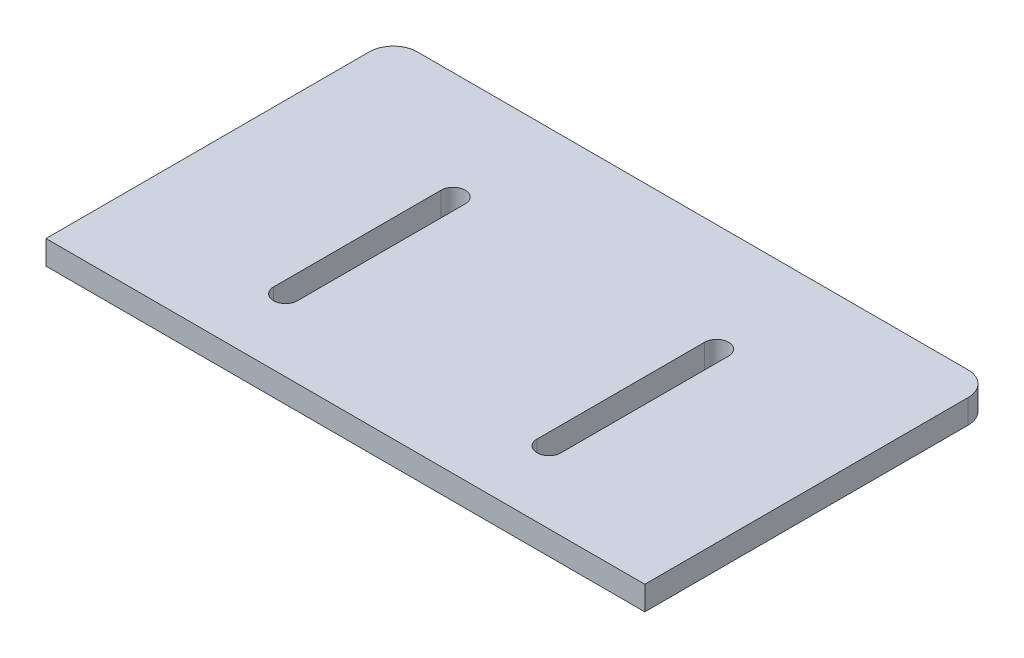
ISO-10303-21;
HEADER;
FILE_DESCRIPTION(('STEP AP214'),'2;1');
FILE_NAME('part.step','',(''),(''),'','','');
FILE_SCHEMA(('AUTOMOTIVE_DESIGN { 1 0 10303 214 1 1 1 1 }'));
ENDSEC;
DATA;
#1=APPLICATION_CONTEXT('core data for automotive mechanical design processes');
#2=APPLICATION_PROTOCOL_DEFINITION('international standard','automotive_design',2000,#1);
#3=PRODUCT_CONTEXT('',#1,'mechanical');
#4=PRODUCT('Part','Part','',(#3));
#5=PRODUCT_RELATED_PRODUCT_CATEGORY('part','',(#4));
#6=PRODUCT_DEFINITION_FORMATION('','',#4);
#7=PRODUCT_DEFINITION_CONTEXT('part definition',#1,'design');
#8=PRODUCT_DEFINITION('design','',#6,#7);
#9=PRODUCT_DEFINITION_SHAPE('','',#8);
#10=(LENGTH_UNIT() NAMED_UNIT(*) SI_UNIT(.MILLI.,.METRE.));
#11=(NAMED_UNIT(*) PLANE_ANGLE_UNIT() SI_UNIT($,.RADIAN.));
#12=(NAMED_UNIT(*) SI_UNIT($,.STERADIAN.) SOLID_ANGLE_UNIT());
#13=UNCERTAINTY_MEASURE_WITH_UNIT(LENGTH_MEASURE(1.E-05),#10,'distance_accuracy_value','');
#14=(GEOMETRIC_REPRESENTATION_CONTEXT(3) GLOBAL_UNCERTAINTY_ASSIGNED_CONTEXT((#13)) GLOBAL_UNIT_ASSIGNED_CONTEXT((#10,
#11,#12)) REPRESENTATION_CONTEXT('',''));
#15=CARTESIAN_POINT('',(0.,0.,0.));
#16=DIRECTION('',(0.,0.,1.));
#17=DIRECTION('',(1.,0.,0.));
#18=AXIS2_PLACEMENT_3D('',#15,#16,#17);
#19=CARTESIAN_POINT('',(-23.,2.,-12.5));
#20=DIRECTION('',(0.,1.,0.));
#21=DIRECTION('',(0.,0.,1.));
#22=AXIS2_PLACEMENT_3D('',#19,#20,#21);
#23=PLANE('',#22);
#24=DIRECTION('',(0.,0.,1.));
#25=VECTOR('',#24,1.);
#26=CARTESIAN_POINT('',(-12.,2.,-5.5));
#27=LINE('',#26,#25);
#28=CARTESIAN_POINT('',(-12.,2.,-5.5));
#29=VERTEX_POINT('',#28);
#30=CARTESIAN_POINT('',(-12.,2.,8.5));
#31=VERTEX_POINT('',#30);
#32=EDGE_CURVE('E171',#29,#31,#27,.T.);
#33=ORIENTED_EDGE('',*,*,#32,.F.);
#34=CARTESIAN_POINT('',(-11.,2.,-5.5));
#35=DIRECTION('',(0.,1.,0.));
#36=DIRECTION('',(0.,0.,1.));
#37=AXIS2_PLACEMENT_3D('',#34,#35,#36);
#38=CIRCLE('',#37,1.);
#39=CARTESIAN_POINT('',(-10.,2.,-5.5));
#40=VERTEX_POINT('',#39);
#41=EDGE_CURVE('E169',#40,#29,#38,.T.);
#42=ORIENTED_EDGE('',*,*,#41,.F.);
#43=DIRECTION('',(0.,0.,-1.));
#44=VECTOR('',#43,1.);
#45=CARTESIAN_POINT('',(-10.,2.,-5.5));
#46=LINE('',#45,#44);
#47=CARTESIAN_POINT('',(-10.,2.,8.5));
#48=VERTEX_POINT('',#47);
#49=EDGE_CURVE('E177',#48,#40,#46,.T.);
#50=ORIENTED_EDGE('',*,*,#49,.F.);
#51=CARTESIAN_POINT('',(-11.,2.,8.5));
#52=DIRECTION('',(0.,1.,0.));
#53=DIRECTION('',(0.,0.,1.));
#54=AXIS2_PLACEMENT_3D('',#51,#52,#53);
#55=CIRCLE('',#54,0.999999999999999);
#56=EDGE_CURVE('E174',#31,#48,#55,.T.);
#57=ORIENTED_EDGE('',*,*,#56,.F.);
#58=EDGE_LOOP('',(#33,#42,#50,#57));
#59=FACE_BOUND('',#58,.T.);
#60=DIRECTION('',(0.,0.,-1.));
#61=VECTOR('',#60,1.);
#62=CARTESIAN_POINT('',(25.,2.,-12.5));
#63=LINE('',#62,#61);
#64=CARTESIAN_POINT('',(25.,2.,14.5));
#65=VERTEX_POINT('',#64);
#66=CARTESIAN_POINT('',(25.,2.,-12.5));
#67=VERTEX_POINT('',#66);
#68=EDGE_CURVE('E200',#65,#67,#63,.T.);
#69=ORIENTED_EDGE('',*,*,#68,.T.);
#70=CARTESIAN_POINT('',(23.,2.,-12.5));
#71=DIRECTION('',(0.,1.,0.));
#72=DIRECTION('',(0.,0.,-1.));
#73=AXIS2_PLACEMENT_3D('',#70,#71,#72);
#74=CIRCLE('',#73,2.);
#75=CARTESIAN_POINT('',(23.,2.,-14.5));
#76=VERTEX_POINT('',#75);
#77=EDGE_CURVE('E203',#67,#76,#74,.T.);
#78=ORIENTED_EDGE('',*,*,#77,.T.);
#79=DIRECTION('',(-1.,0.,0.));
#80=VECTOR('',#79,1.);
#81=CARTESIAN_POINT('',(-23.,2.,-14.5));
#82=LINE('',#81,#80);
#83=CARTESIAN_POINT('',(-23.,2.,-14.5));
#84=VERTEX_POINT('',#83);
#85=EDGE_CURVE('E206',#76,#84,#82,.T.);
#86=ORIENTED_EDGE('',*,*,#85,.T.);
#87=CARTESIAN_POINT('',(-23.,2.,-12.5));
#88=DIRECTION('',(0.,1.,0.));
#89=DIRECTION('',(0.,0.,1.));
#90=AXIS2_PLACEMENT_3D('',#87,#88,#89);
#91=CIRCLE('',#90,2.);
#92=CARTESIAN_POINT('',(-25.,2.,-12.5));
#93=VERTEX_POINT('',#92);
#94=EDGE_CURVE('E208',#84,#93,#91,.T.);
#95=ORIENTED_EDGE('',*,*,#94,.T.);
#96=DIRECTION('',(0.,0.,1.));
#97=VECTOR('',#96,1.);
#98=CARTESIAN_POINT('',(-25.,2.,-12.5));
#99=LINE('',#98,#97);
#100=CARTESIAN_POINT('',(-25.,2.,14.5));
#101=VERTEX_POINT('',#100);
#102=EDGE_CURVE('E210',#93,#101,#99,.T.);
#103=ORIENTED_EDGE('',*,*,#102,.T.);
#104=DIRECTION('',(1.,0.,0.));
#105=VECTOR('',#104,1.);
#106=CARTESIAN_POINT('',(-25.,2.,14.5));
#107=LINE('',#106,#105);
#108=EDGE_CURVE('E212',#101,#65,#107,.T.);
#109=ORIENTED_EDGE('',*,*,#108,.T.);
#110=EDGE_LOOP('',(#69,#78,#86,#95,#103,#109));
#111=FACE_BOUND('',#110,.T.);
#112=DIRECTION('',(0.,0.,1.));
#113=VECTOR('',#112,1.);
#114=CARTESIAN_POINT('',(10.,2.,-5.5));
#115=LINE('',#114,#113);
#116=CARTESIAN_POINT('',(10.,2.,-5.5));
#117=VERTEX_POINT('',#116);
#118=CARTESIAN_POINT('',(10.,2.,8.5));
#119=VERTEX_POINT('',#118);
#120=EDGE_CURVE('E141',#117,#119,#115,.T.);
#121=ORIENTED_EDGE('',*,*,#120,.F.);
#122=CARTESIAN_POINT('',(11.,2.,-5.5));
#123=DIRECTION('',(0.,1.,0.));
#124=DIRECTION('',(0.,0.,-1.));
#125=AXIS2_PLACEMENT_3D('',#122,#123,#124);
#126=CIRCLE('',#125,1.);
#127=CARTESIAN_POINT('',(12.,2.,-5.5));
#128=VERTEX_POINT('',#127);
#129=EDGE_CURVE('E133',#128,#117,#126,.T.);
#130=ORIENTED_EDGE('',*,*,#129,.F.);
#131=DIRECTION('',(0.,0.,-1.));
#132=VECTOR('',#131,1.);
#133=CARTESIAN_POINT('',(12.,2.,-5.5));
#134=LINE('',#133,#132);
#135=CARTESIAN_POINT('',(12.,2.,8.5));
#136=VERTEX_POINT('',#135);
#137=EDGE_CURVE('E155',#136,#128,#134,.T.);
#138=ORIENTED_EDGE('',*,*,#137,.F.);
#139=CARTESIAN_POINT('',(11.,2.,8.5));
#140=DIRECTION('',(0.,1.,0.));
#141=DIRECTION('',(0.,0.,-1.));
#142=AXIS2_PLACEMENT_3D('',#139,#140,#141);
#143=CIRCLE('',#142,0.999999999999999);
#144=EDGE_CURVE('E153',#119,#136,#143,.T.);
#145=ORIENTED_EDGE('',*,*,#144,.F.);
#146=EDGE_LOOP('',(#121,#130,#138,#145));
#147=FACE_BOUND('',#146,.T.);
#148=ADVANCED_FACE('F32',(#59,#111,#147),#23,.T.);
#149=CARTESIAN_POINT('',(-23.,0.,-12.5));
#150=DIRECTION('',(0.,1.,0.));
#151=DIRECTION('',(0.,0.,1.));
#152=AXIS2_PLACEMENT_3D('',#149,#150,#151);
#153=PLANE('',#152);
#154=CARTESIAN_POINT('',(-11.,0.,-5.5));
#155=DIRECTION('',(0.,1.,0.));
#156=DIRECTION('',(0.,0.,1.));
#157=AXIS2_PLACEMENT_3D('',#154,#155,#156);
#158=CIRCLE('',#157,1.);
#159=CARTESIAN_POINT('',(-10.,0.,-5.5));
#160=VERTEX_POINT('',#159);
#161=CARTESIAN_POINT('',(-12.,0.,-5.5));
#162=VERTEX_POINT('',#161);
#163=EDGE_CURVE('E149',#160,#162,#158,.T.);
#164=ORIENTED_EDGE('',*,*,#163,.T.);
#165=DIRECTION('',(0.,0.,1.));
#166=VECTOR('',#165,1.);
#167=CARTESIAN_POINT('',(-12.,0.,-5.5));
#168=LINE('',#167,#166);
#169=CARTESIAN_POINT('',(-12.,0.,8.5));
#170=VERTEX_POINT('',#169);
#171=EDGE_CURVE('E182',#162,#170,#168,.T.);
#172=ORIENTED_EDGE('',*,*,#171,.T.);
#173=CARTESIAN_POINT('',(-11.,0.,8.5));
#174=DIRECTION('',(0.,1.,0.));
#175=DIRECTION('',(0.,0.,1.));
#176=AXIS2_PLACEMENT_3D('',#173,#174,#175);
#177=CIRCLE('',#176,0.999999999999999);
#178=CARTESIAN_POINT('',(-10.,0.,8.5));
#179=VERTEX_POINT('',#178);
#180=EDGE_CURVE('E185',#170,#179,#177,.T.);
#181=ORIENTED_EDGE('',*,*,#180,.T.);
#182=DIRECTION('',(0.,0.,-1.));
#183=VECTOR('',#182,1.);
#184=CARTESIAN_POINT('',(-10.,0.,-5.5));
#185=LINE('',#184,#183);
#186=EDGE_CURVE('E172',#179,#160,#185,.T.);
#187=ORIENTED_EDGE('',*,*,#186,.T.);
#188=EDGE_LOOP('',(#164,#172,#181,#187));
#189=FACE_BOUND('',#188,.T.);
#190=DIRECTION('',(0.,0.,-1.));
#191=VECTOR('',#190,1.);
#192=CARTESIAN_POINT('',(25.,0.,-12.5));
#193=LINE('',#192,#191);
#194=CARTESIAN_POINT('',(25.,0.,14.5));
#195=VERTEX_POINT('',#194);
#196=CARTESIAN_POINT('',(25.,0.,-12.5));
#197=VERTEX_POINT('',#196);
#198=EDGE_CURVE('E199',#195,#197,#193,.T.);
#199=ORIENTED_EDGE('',*,*,#198,.F.);
#200=DIRECTION('',(1.,0.,0.));
#201=VECTOR('',#200,1.);
#202=CARTESIAN_POINT('',(-25.,0.,14.5));
#203=LINE('',#202,#201);
#204=CARTESIAN_POINT('',(-25.,0.,14.5));
#205=VERTEX_POINT('',#204);
#206=EDGE_CURVE('E204',#205,#195,#203,.T.);
#207=ORIENTED_EDGE('',*,*,#206,.F.);
#208=DIRECTION('',(0.,0.,1.));
#209=VECTOR('',#208,1.);
#210=CARTESIAN_POINT('',(-25.,0.,-12.5));
#211=LINE('',#210,#209);
#212=CARTESIAN_POINT('',(-25.,0.,-12.5));
#213=VERTEX_POINT('',#212);
#214=EDGE_CURVE('E223',#213,#205,#211,.T.);
#215=ORIENTED_EDGE('',*,*,#214,.F.);
#216=CARTESIAN_POINT('',(-23.,0.,-12.5));
#217=DIRECTION('',(0.,1.,0.));
#218=DIRECTION('',(0.,0.,1.));
#219=AXIS2_PLACEMENT_3D('',#216,#217,#218);
#220=CIRCLE('',#219,2.);
#221=CARTESIAN_POINT('',(-23.,0.,-14.5));
#222=VERTEX_POINT('',#221);
#223=EDGE_CURVE('E221',#222,#213,#220,.T.);
#224=ORIENTED_EDGE('',*,*,#223,.F.);
#225=DIRECTION('',(-1.,0.,0.));
#226=VECTOR('',#225,1.);
#227=CARTESIAN_POINT('',(-23.,0.,-14.5));
#228=LINE('',#227,#226);
#229=CARTESIAN_POINT('',(23.,0.,-14.5));
#230=VERTEX_POINT('',#229);
#231=EDGE_CURVE('E219',#230,#222,#228,.T.);
#232=ORIENTED_EDGE('',*,*,#231,.F.);
#233=CARTESIAN_POINT('',(23.,0.,-12.5));
#234=DIRECTION('',(0.,1.,0.));
#235=DIRECTION('',(0.,0.,-1.));
#236=AXIS2_PLACEMENT_3D('',#233,#234,#235);
#237=CIRCLE('',#236,2.);
#238=EDGE_CURVE('E217',#197,#230,#237,.T.);
#239=ORIENTED_EDGE('',*,*,#238,.F.);
#240=EDGE_LOOP('',(#199,#207,#215,#224,#232,#239));
#241=FACE_BOUND('',#240,.T.);
#242=CARTESIAN_POINT('',(11.,0.,-5.5));
#243=DIRECTION('',(0.,1.,0.));
#244=DIRECTION('',(0.,0.,-1.));
#245=AXIS2_PLACEMENT_3D('',#242,#243,#244);
#246=CIRCLE('',#245,1.);
#247=CARTESIAN_POINT('',(12.,0.,-5.5));
#248=VERTEX_POINT('',#247);
#249=CARTESIAN_POINT('',(10.,0.,-5.5));
#250=VERTEX_POINT('',#249);
#251=EDGE_CURVE('E55',#248,#250,#246,.T.);
#252=ORIENTED_EDGE('',*,*,#251,.T.);
#253=DIRECTION('',(0.,0.,1.));
#254=VECTOR('',#253,1.);
#255=CARTESIAN_POINT('',(10.,0.,-5.5));
#256=LINE('',#255,#254);
#257=CARTESIAN_POINT('',(10.,0.,8.5));
#258=VERTEX_POINT('',#257);
#259=EDGE_CURVE('E148',#250,#258,#256,.T.);
#260=ORIENTED_EDGE('',*,*,#259,.T.);
#261=CARTESIAN_POINT('',(11.,0.,8.5));
#262=DIRECTION('',(0.,1.,0.));
#263=DIRECTION('',(0.,0.,-1.));
#264=AXIS2_PLACEMENT_3D('',#261,#262,#263);
#265=CIRCLE('',#264,0.999999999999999);
#266=CARTESIAN_POINT('',(12.,0.,8.5));
#267=VERTEX_POINT('',#266);
#268=EDGE_CURVE('E161',#258,#267,#265,.T.);
#269=ORIENTED_EDGE('',*,*,#268,.T.);
#270=DIRECTION('',(0.,0.,-1.));
#271=VECTOR('',#270,1.);
#272=CARTESIAN_POINT('',(12.,0.,-5.5));
#273=LINE('',#272,#271);
#274=EDGE_CURVE('E142',#267,#248,#273,.T.);
#275=ORIENTED_EDGE('',*,*,#274,.T.);
#276=EDGE_LOOP('',(#252,#260,#269,#275));
#277=FACE_BOUND('',#276,.T.);
#278=ADVANCED_FACE('F247',(#189,#241,#277),#153,.F.);
#279=CARTESIAN_POINT('',(25.,2.,-12.5));
#280=DIRECTION('',(-1.,0.,0.));
#281=DIRECTION('',(0.,0.,1.));
#282=AXIS2_PLACEMENT_3D('',#279,#280,#281);
#283=PLANE('',#282);
#284=ORIENTED_EDGE('',*,*,#198,.T.);
#285=DIRECTION('',(0.,-1.,0.));
#286=VECTOR('',#285,1.);
#287=CARTESIAN_POINT('',(25.,2.,-12.5));
#288=LINE('',#287,#286);
#289=EDGE_CURVE('E11',#67,#197,#288,.T.);
#290=ORIENTED_EDGE('',*,*,#289,.F.);
#291=ORIENTED_EDGE('',*,*,#68,.F.);
#292=DIRECTION('',(0.,-1.,0.));
#293=VECTOR('',#292,1.);
#294=CARTESIAN_POINT('',(25.,2.,14.5));
#295=LINE('',#294,#293);
#296=EDGE_CURVE('E214',#65,#195,#295,.T.);
#297=ORIENTED_EDGE('',*,*,#296,.T.);
#298=EDGE_LOOP('',(#284,#290,#291,#297));
#299=FACE_BOUND('',#298,.T.);
#300=ADVANCED_FACE('F34',(#299),#283,.F.);
#301=CARTESIAN_POINT('',(23.,2.,-12.5));
#302=DIRECTION('',(0.,-1.,0.));
#303=DIRECTION('',(0.,0.,-1.));
#304=AXIS2_PLACEMENT_3D('',#301,#302,#303);
#305=CYLINDRICAL_SURFACE('',#304,2.);
#306=ORIENTED_EDGE('',*,*,#238,.T.);
#307=DIRECTION('',(0.,-1.,0.));
#308=VECTOR('',#307,1.);
#309=CARTESIAN_POINT('',(23.,2.,-14.5));
#310=LINE('',#309,#308);
#311=EDGE_CURVE('E40',#76,#230,#310,.T.);
#312=ORIENTED_EDGE('',*,*,#311,.F.);
#313=ORIENTED_EDGE('',*,*,#77,.F.);
#314=ORIENTED_EDGE('',*,*,#289,.T.);
#315=EDGE_LOOP('',(#306,#312,#313,#314));
#316=FACE_BOUND('',#315,.T.);
#317=ADVANCED_FACE('F264',(#316),#305,.T.);
#318=CARTESIAN_POINT('',(-23.,2.,-14.5));
#319=DIRECTION('',(0.,0.,1.));
#320=DIRECTION('',(1.,0.,0.));
#321=AXIS2_PLACEMENT_3D('',#318,#319,#320);
#322=PLANE('',#321);
#323=ORIENTED_EDGE('',*,*,#231,.T.);
#324=DIRECTION('',(0.,-1.,0.));
#325=VECTOR('',#324,1.);
#326=CARTESIAN_POINT('',(-23.,2.,-14.5));
#327=LINE('',#326,#325);
#328=EDGE_CURVE('E234',#84,#222,#327,.T.);
#329=ORIENTED_EDGE('',*,*,#328,.F.);
#330=ORIENTED_EDGE('',*,*,#85,.F.);
#331=ORIENTED_EDGE('',*,*,#311,.T.);
#332=EDGE_LOOP('',(#323,#329,#330,#331));
#333=FACE_BOUND('',#332,.T.);
#334=ADVANCED_FACE('F241',(#333),#322,.F.);
#335=CARTESIAN_POINT('',(-23.,2.,-12.5));
#336=DIRECTION('',(0.,-1.,0.));
#337=DIRECTION('',(0.,0.,-1.));
#338=AXIS2_PLACEMENT_3D('',#335,#336,#337);
#339=CYLINDRICAL_SURFACE('',#338,2.);
#340=ORIENTED_EDGE('',*,*,#223,.T.);
#341=DIRECTION('',(0.,-1.,0.));
#342=VECTOR('',#341,1.);
#343=CARTESIAN_POINT('',(-25.,2.,-12.5));
#344=LINE('',#343,#342);
#345=EDGE_CURVE('E231',#93,#213,#344,.T.);
#346=ORIENTED_EDGE('',*,*,#345,.F.);
#347=ORIENTED_EDGE('',*,*,#94,.F.);
#348=ORIENTED_EDGE('',*,*,#328,.T.);
#349=EDGE_LOOP('',(#340,#346,#347,#348));
#350=FACE_BOUND('',#349,.T.);
#351=ADVANCED_FACE('F253',(#350),#339,.T.);
#352=CARTESIAN_POINT('',(-25.,2.,-12.5));
#353=DIRECTION('',(1.,0.,0.));
#354=DIRECTION('',(0.,0.,-1.));
#355=AXIS2_PLACEMENT_3D('',#352,#353,#354);
#356=PLANE('',#355);
#357=ORIENTED_EDGE('',*,*,#214,.T.);
#358=DIRECTION('',(0.,-1.,0.));
#359=VECTOR('',#358,1.);
#360=CARTESIAN_POINT('',(-25.,2.,14.5));
#361=LINE('',#360,#359);
#362=EDGE_CURVE('E228',#101,#205,#361,.T.);
#363=ORIENTED_EDGE('',*,*,#362,.F.);
#364=ORIENTED_EDGE('',*,*,#102,.F.);
#365=ORIENTED_EDGE('',*,*,#345,.T.);
#366=EDGE_LOOP('',(#357,#363,#364,#365));
#367=FACE_BOUND('',#366,.T.);
#368=ADVANCED_FACE('F257',(#367),#356,.F.);
#369=CARTESIAN_POINT('',(-25.,2.,14.5));
#370=DIRECTION('',(0.,0.,-1.));
#371=DIRECTION('',(-1.,0.,0.));
#372=AXIS2_PLACEMENT_3D('',#369,#370,#371);
#373=PLANE('',#372);
#374=ORIENTED_EDGE('',*,*,#206,.T.);
#375=ORIENTED_EDGE('',*,*,#296,.F.);
#376=ORIENTED_EDGE('',*,*,#108,.F.);
#377=ORIENTED_EDGE('',*,*,#362,.T.);
#378=EDGE_LOOP('',(#374,#375,#376,#377));
#379=FACE_BOUND('',#378,.T.);
#380=ADVANCED_FACE('F267',(#379),#373,.F.);
#381=CARTESIAN_POINT('',(-11.,2.,-5.5));
#382=DIRECTION('',(0.,-1.,0.));
#383=DIRECTION('',(0.,0.,-1.));
#384=AXIS2_PLACEMENT_3D('',#381,#382,#383);
#385=CYLINDRICAL_SURFACE('',#384,1.);
#386=ORIENTED_EDGE('',*,*,#163,.F.);
#387=DIRECTION('',(0.,-1.,0.));
#388=VECTOR('',#387,1.);
#389=CARTESIAN_POINT('',(-10.,2.,-5.5));
#390=LINE('',#389,#388);
#391=EDGE_CURVE('E179',#40,#160,#390,.T.);
#392=ORIENTED_EDGE('',*,*,#391,.F.);
#393=ORIENTED_EDGE('',*,*,#41,.T.);
#394=DIRECTION('',(0.,-1.,0.));
#395=VECTOR('',#394,1.);
#396=CARTESIAN_POINT('',(-12.,2.,-5.5));
#397=LINE('',#396,#395);
#398=EDGE_CURVE('E196',#29,#162,#397,.T.);
#399=ORIENTED_EDGE('',*,*,#398,.T.);
#400=EDGE_LOOP('',(#386,#392,#393,#399));
#401=FACE_BOUND('',#400,.T.);
#402=ADVANCED_FACE('F269',(#401),#385,.F.);
#403=CARTESIAN_POINT('',(-12.,2.,-5.5));
#404=DIRECTION('',(1.,0.,0.));
#405=DIRECTION('',(0.,0.,-1.));
#406=AXIS2_PLACEMENT_3D('',#403,#404,#405);
#407=PLANE('',#406);
#408=ORIENTED_EDGE('',*,*,#171,.F.);
#409=ORIENTED_EDGE('',*,*,#398,.F.);
#410=ORIENTED_EDGE('',*,*,#32,.T.);
#411=DIRECTION('',(0.,-1.,0.));
#412=VECTOR('',#411,1.);
#413=CARTESIAN_POINT('',(-12.,2.,8.5));
#414=LINE('',#413,#412);
#415=EDGE_CURVE('E194',#31,#170,#414,.T.);
#416=ORIENTED_EDGE('',*,*,#415,.T.);
#417=EDGE_LOOP('',(#408,#409,#410,#416));
#418=FACE_BOUND('',#417,.T.);
#419=ADVANCED_FACE('F275',(#418),#407,.T.);
#420=CARTESIAN_POINT('',(-11.,2.,8.5));
#421=DIRECTION('',(0.,-1.,0.));
#422=DIRECTION('',(0.,0.,-1.));
#423=AXIS2_PLACEMENT_3D('',#420,#421,#422);
#424=CYLINDRICAL_SURFACE('',#423,0.999999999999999);
#425=ORIENTED_EDGE('',*,*,#180,.F.);
#426=ORIENTED_EDGE('',*,*,#415,.F.);
#427=ORIENTED_EDGE('',*,*,#56,.T.);
#428=DIRECTION('',(0.,-1.,0.));
#429=VECTOR('',#428,1.);
#430=CARTESIAN_POINT('',(-10.,2.,8.5));
#431=LINE('',#430,#429);
#432=EDGE_CURVE('E192',#48,#179,#431,.T.);
#433=ORIENTED_EDGE('',*,*,#432,.T.);
#434=EDGE_LOOP('',(#425,#426,#427,#433));
#435=FACE_BOUND('',#434,.T.);
#436=ADVANCED_FACE('F291',(#435),#424,.F.);
#437=CARTESIAN_POINT('',(-10.,2.,-5.5));
#438=DIRECTION('',(-1.,0.,0.));
#439=DIRECTION('',(0.,0.,1.));
#440=AXIS2_PLACEMENT_3D('',#437,#438,#439);
#441=PLANE('',#440);
#442=ORIENTED_EDGE('',*,*,#186,.F.);
#443=ORIENTED_EDGE('',*,*,#432,.F.);
#444=ORIENTED_EDGE('',*,*,#49,.T.);
#445=ORIENTED_EDGE('',*,*,#391,.T.);
#446=EDGE_LOOP('',(#442,#443,#444,#445));
#447=FACE_BOUND('',#446,.T.);
#448=ADVANCED_FACE('F295',(#447),#441,.T.);
#449=CARTESIAN_POINT('',(11.,2.,-5.5));
#450=DIRECTION('',(0.,-1.,0.));
#451=DIRECTION('',(0.,0.,-1.));
#452=AXIS2_PLACEMENT_3D('',#449,#450,#451);
#453=CYLINDRICAL_SURFACE('',#452,1.);
#454=ORIENTED_EDGE('',*,*,#251,.F.);
#455=DIRECTION('',(0.,-1.,0.));
#456=VECTOR('',#455,1.);
#457=CARTESIAN_POINT('',(12.,2.,-5.5));
#458=LINE('',#457,#456);
#459=EDGE_CURVE('E137',#128,#248,#458,.T.);
#460=ORIENTED_EDGE('',*,*,#459,.F.);
#461=ORIENTED_EDGE('',*,*,#129,.T.);
#462=DIRECTION('',(0.,-1.,0.));
#463=VECTOR('',#462,1.);
#464=CARTESIAN_POINT('',(10.,2.,-5.5));
#465=LINE('',#464,#463);
#466=EDGE_CURVE('E136',#117,#250,#465,.T.);
#467=ORIENTED_EDGE('',*,*,#466,.T.);
#468=EDGE_LOOP('',(#454,#460,#461,#467));
#469=FACE_BOUND('',#468,.T.);
#470=ADVANCED_FACE('F135',(#469),#453,.F.);
#471=CARTESIAN_POINT('',(10.,2.,-5.5));
#472=DIRECTION('',(1.,0.,0.));
#473=DIRECTION('',(0.,0.,-1.));
#474=AXIS2_PLACEMENT_3D('',#471,#472,#473);
#475=PLANE('',#474);
#476=ORIENTED_EDGE('',*,*,#259,.F.);
#477=ORIENTED_EDGE('',*,*,#466,.F.);
#478=ORIENTED_EDGE('',*,*,#120,.T.);
#479=DIRECTION('',(0.,-1.,0.));
#480=VECTOR('',#479,1.);
#481=CARTESIAN_POINT('',(10.,2.,8.5));
#482=LINE('',#481,#480);
#483=EDGE_CURVE('E150',#119,#258,#482,.T.);
#484=ORIENTED_EDGE('',*,*,#483,.T.);
#485=EDGE_LOOP('',(#476,#477,#478,#484));
#486=FACE_BOUND('',#485,.T.);
#487=ADVANCED_FACE('F145',(#486),#475,.T.);
#488=CARTESIAN_POINT('',(11.,2.,8.5));
#489=DIRECTION('',(0.,-1.,0.));
#490=DIRECTION('',(0.,0.,-1.));
#491=AXIS2_PLACEMENT_3D('',#488,#489,#490);
#492=CYLINDRICAL_SURFACE('',#491,0.999999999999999);
#493=ORIENTED_EDGE('',*,*,#268,.F.);
#494=ORIENTED_EDGE('',*,*,#483,.F.);
#495=ORIENTED_EDGE('',*,*,#144,.T.);
#496=DIRECTION('',(0.,-1.,0.));
#497=VECTOR('',#496,1.);
#498=CARTESIAN_POINT('',(12.,2.,8.5));
#499=LINE('',#498,#497);
#500=EDGE_CURVE('E47',#136,#267,#499,.T.);
#501=ORIENTED_EDGE('',*,*,#500,.T.);
#502=EDGE_LOOP('',(#493,#494,#495,#501));
#503=FACE_BOUND('',#502,.T.);
#504=ADVANCED_FACE('F304',(#503),#492,.F.);
#505=CARTESIAN_POINT('',(12.,2.,-5.5));
#506=DIRECTION('',(-1.,0.,0.));
#507=DIRECTION('',(0.,0.,1.));
#508=AXIS2_PLACEMENT_3D('',#505,#506,#507);
#509=PLANE('',#508);
#510=ORIENTED_EDGE('',*,*,#274,.F.);
#511=ORIENTED_EDGE('',*,*,#500,.F.);
#512=ORIENTED_EDGE('',*,*,#137,.T.);
#513=ORIENTED_EDGE('',*,*,#459,.T.);
#514=EDGE_LOOP('',(#510,#511,#512,#513));
#515=FACE_BOUND('',#514,.T.);
#516=ADVANCED_FACE('F307',(#515),#509,.T.);
#517=CLOSED_SHELL('',(#148,#278,#300,#317,#334,#351,#368,#380,#402,#419,#436,#448,#470,#487,
#504,#516));
#518=MANIFOLD_SOLID_BREP('B2',#517);
#519=ADVANCED_BREP_SHAPE_REPRESENTATION('',(#18,#518),#14);
#520=SHAPE_DEFINITION_REPRESENTATION(#9,#519);
ENDSEC;
END-ISO-10303-21;
